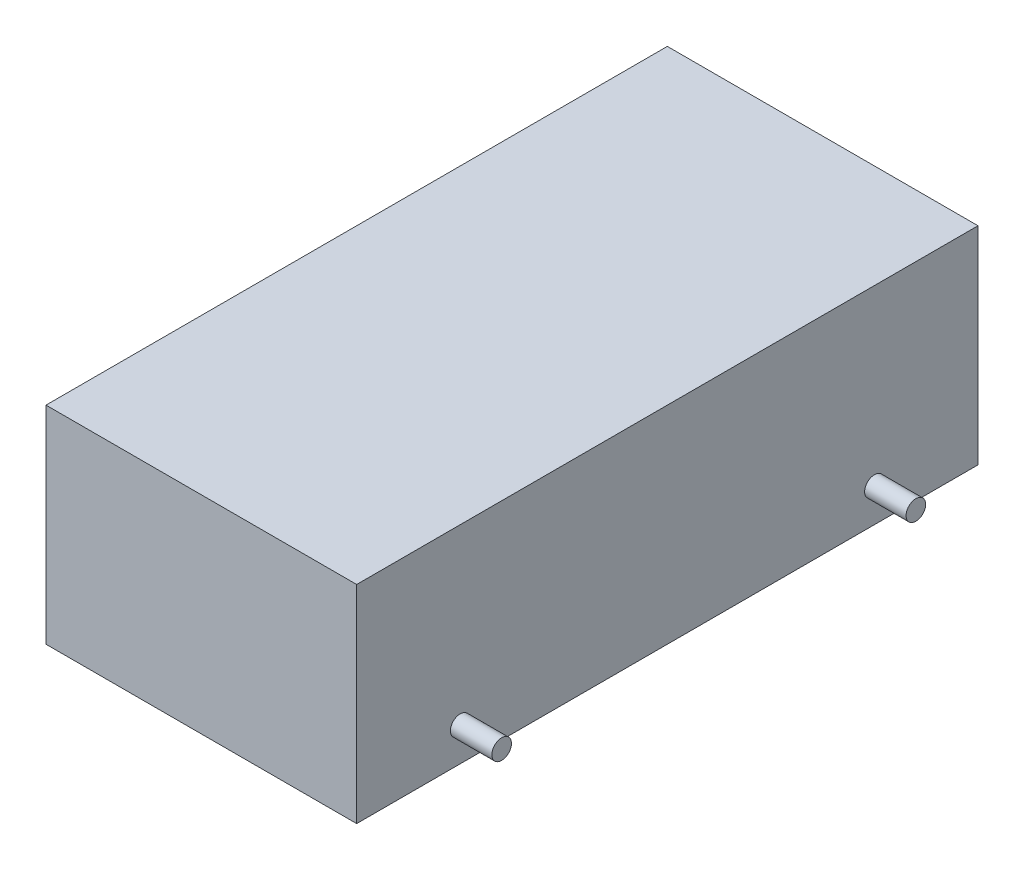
from build123d import *

# Parameters (mm, degrees)
SKETCH1_W           = 75
SKETCH1_H           = 50
BOSS_EXTRUDE1_DEPTH = 150
SKETCH2_R           = 2.369647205
BOSS_EXTRUDE2_DEPTH = 10
BOSS_EXTRUDE3_START = 10
SKETCH3_R           = 2.369647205
BOSS_EXTRUDE3_DEPTH = 10


with BuildPart() as part:
    # Sketch1 → Boss-Extrude1 (new body)
    with BuildSketch(Plane.XY):
        Rectangle(SKETCH1_W, SKETCH1_H)
    extrude(amount=BOSS_EXTRUDE1_DEPTH)

    # Sketch2 → Boss-Extrude2 (add)
    with BuildSketch(Plane(origin=(37.5, 0, 0), x_dir=(0, 0, -1), z_dir=(1, 0, 0))):
        with Locations(Location((-125, -16.919154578, 0), (0, 0, 270))):
            Circle(SKETCH2_R)
        with Locations(Location((-25, -16.919154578, 0), (0, 0, 270))):
            Circle(SKETCH2_R)
    extrude(amount=BOSS_EXTRUDE2_DEPTH)

    # Sketch3 → Boss-Extrude3 (add)
    with BuildSketch(Plane.ZY.offset(37.5).offset(BOSS_EXTRUDE3_START)):
        with Locations(Location((25, -16.919154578, 0), (0, 0, 270))):
            Circle(SKETCH3_R)
        with Locations(Location((125, -16.919154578, 0), (0, 0, 270))):
            Circle(SKETCH3_R)
    extrude(amount=-BOSS_EXTRUDE3_DEPTH)


solid = part.part
